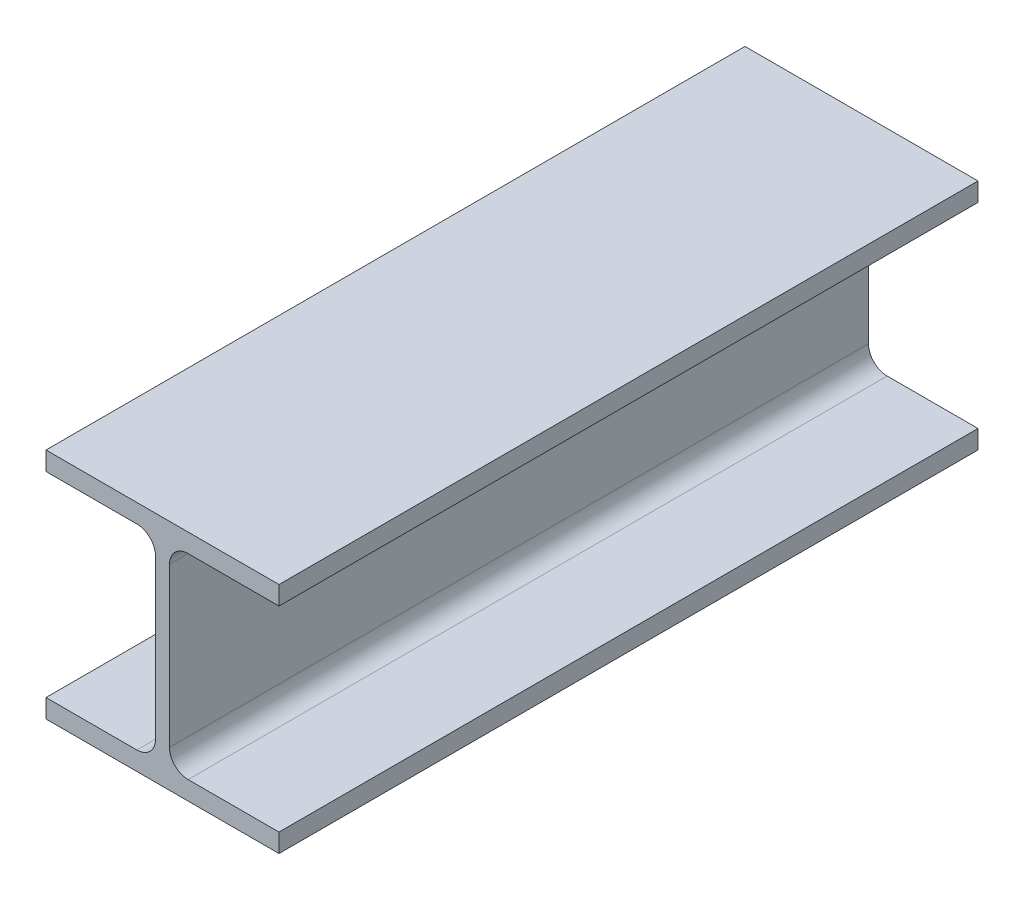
ISO-10303-21;
HEADER;
FILE_DESCRIPTION(('STEP AP214'),'2;1');
FILE_NAME('part.step','',(''),(''),'','','');
FILE_SCHEMA(('AUTOMOTIVE_DESIGN { 1 0 10303 214 1 1 1 1 }'));
ENDSEC;
DATA;
#1=APPLICATION_CONTEXT('core data for automotive mechanical design processes');
#2=APPLICATION_PROTOCOL_DEFINITION('international standard','automotive_design',2000,#1);
#3=PRODUCT_CONTEXT('',#1,'mechanical');
#4=PRODUCT('Part','Part','',(#3));
#5=PRODUCT_RELATED_PRODUCT_CATEGORY('part','',(#4));
#6=PRODUCT_DEFINITION_FORMATION('','',#4);
#7=PRODUCT_DEFINITION_CONTEXT('part definition',#1,'design');
#8=PRODUCT_DEFINITION('design','',#6,#7);
#9=PRODUCT_DEFINITION_SHAPE('','',#8);
#10=(LENGTH_UNIT() NAMED_UNIT(*) SI_UNIT(.MILLI.,.METRE.));
#11=(NAMED_UNIT(*) PLANE_ANGLE_UNIT() SI_UNIT($,.RADIAN.));
#12=(NAMED_UNIT(*) SI_UNIT($,.STERADIAN.) SOLID_ANGLE_UNIT());
#13=UNCERTAINTY_MEASURE_WITH_UNIT(LENGTH_MEASURE(1.E-05),#10,'distance_accuracy_value','');
#14=(GEOMETRIC_REPRESENTATION_CONTEXT(3) GLOBAL_UNCERTAINTY_ASSIGNED_CONTEXT((#13)) GLOBAL_UNIT_ASSIGNED_CONTEXT((#10,
#11,#12)) REPRESENTATION_CONTEXT('',''));
#15=CARTESIAN_POINT('',(0.,0.,0.));
#16=DIRECTION('',(0.,0.,1.));
#17=DIRECTION('',(1.,0.,0.));
#18=AXIS2_PLACEMENT_3D('',#15,#16,#17);
#19=CARTESIAN_POINT('',(-50.,-50.,300.));
#20=DIRECTION('',(1.,0.,0.));
#21=DIRECTION('',(0.,0.,-1.));
#22=AXIS2_PLACEMENT_3D('',#19,#20,#21);
#23=PLANE('',#22);
#24=DIRECTION('',(0.,-1.,0.));
#25=VECTOR('',#24,1.);
#26=CARTESIAN_POINT('',(-50.,-50.,0.));
#27=LINE('',#26,#25);
#28=CARTESIAN_POINT('',(-50.,-42.,0.));
#29=VERTEX_POINT('',#28);
#30=CARTESIAN_POINT('',(-50.,-50.,0.));
#31=VERTEX_POINT('',#30);
#32=EDGE_CURVE('E176',#29,#31,#27,.T.);
#33=ORIENTED_EDGE('',*,*,#32,.T.);
#34=DIRECTION('',(0.,0.,-1.));
#35=VECTOR('',#34,1.);
#36=CARTESIAN_POINT('',(-50.,-50.,300.));
#37=LINE('',#36,#35);
#38=CARTESIAN_POINT('',(-50.,-50.,300.));
#39=VERTEX_POINT('',#38);
#40=EDGE_CURVE('E11',#39,#31,#37,.T.);
#41=ORIENTED_EDGE('',*,*,#40,.F.);
#42=DIRECTION('',(0.,-1.,0.));
#43=VECTOR('',#42,1.);
#44=CARTESIAN_POINT('',(-50.,-50.,300.));
#45=LINE('',#44,#43);
#46=CARTESIAN_POINT('',(-50.,-42.,300.));
#47=VERTEX_POINT('',#46);
#48=EDGE_CURVE('E206',#47,#39,#45,.T.);
#49=ORIENTED_EDGE('',*,*,#48,.F.);
#50=DIRECTION('',(0.,0.,-1.));
#51=VECTOR('',#50,1.);
#52=CARTESIAN_POINT('',(-50.,-42.,300.));
#53=LINE('',#52,#51);
#54=EDGE_CURVE('E172',#47,#29,#53,.T.);
#55=ORIENTED_EDGE('',*,*,#54,.T.);
#56=EDGE_LOOP('',(#33,#41,#49,#55));
#57=FACE_BOUND('',#56,.T.);
#58=ADVANCED_FACE('F32',(#57),#23,.F.);
#59=CARTESIAN_POINT('',(50.,-50.,300.));
#60=DIRECTION('',(0.,1.,0.));
#61=DIRECTION('',(0.,0.,1.));
#62=AXIS2_PLACEMENT_3D('',#59,#60,#61);
#63=PLANE('',#62);
#64=DIRECTION('',(1.,0.,0.));
#65=VECTOR('',#64,1.);
#66=CARTESIAN_POINT('',(50.,-50.,0.));
#67=LINE('',#66,#65);
#68=CARTESIAN_POINT('',(50.,-50.,0.));
#69=VERTEX_POINT('',#68);
#70=EDGE_CURVE('E179',#31,#69,#67,.T.);
#71=ORIENTED_EDGE('',*,*,#70,.T.);
#72=DIRECTION('',(0.,0.,-1.));
#73=VECTOR('',#72,1.);
#74=CARTESIAN_POINT('',(50.,-50.,300.));
#75=LINE('',#74,#73);
#76=CARTESIAN_POINT('',(50.,-50.,300.));
#77=VERTEX_POINT('',#76);
#78=EDGE_CURVE('E40',#77,#69,#75,.T.);
#79=ORIENTED_EDGE('',*,*,#78,.F.);
#80=DIRECTION('',(1.,0.,0.));
#81=VECTOR('',#80,1.);
#82=CARTESIAN_POINT('',(50.,-50.,300.));
#83=LINE('',#82,#81);
#84=EDGE_CURVE('E115',#39,#77,#83,.T.);
#85=ORIENTED_EDGE('',*,*,#84,.F.);
#86=ORIENTED_EDGE('',*,*,#40,.T.);
#87=EDGE_LOOP('',(#71,#79,#85,#86));
#88=FACE_BOUND('',#87,.T.);
#89=ADVANCED_FACE('F304',(#88),#63,.F.);
#90=CARTESIAN_POINT('',(50.,-50.,300.));
#91=DIRECTION('',(-1.,0.,0.));
#92=DIRECTION('',(0.,0.,1.));
#93=AXIS2_PLACEMENT_3D('',#90,#91,#92);
#94=PLANE('',#93);
#95=DIRECTION('',(0.,1.,0.));
#96=VECTOR('',#95,1.);
#97=CARTESIAN_POINT('',(50.,-50.,0.));
#98=LINE('',#97,#96);
#99=CARTESIAN_POINT('',(50.,-42.,0.));
#100=VERTEX_POINT('',#99);
#101=EDGE_CURVE('E181',#69,#100,#98,.T.);
#102=ORIENTED_EDGE('',*,*,#101,.T.);
#103=DIRECTION('',(0.,0.,-1.));
#104=VECTOR('',#103,1.);
#105=CARTESIAN_POINT('',(50.,-42.,300.));
#106=LINE('',#105,#104);
#107=CARTESIAN_POINT('',(50.,-42.,300.));
#108=VERTEX_POINT('',#107);
#109=EDGE_CURVE('E237',#108,#100,#106,.T.);
#110=ORIENTED_EDGE('',*,*,#109,.F.);
#111=DIRECTION('',(0.,1.,0.));
#112=VECTOR('',#111,1.);
#113=CARTESIAN_POINT('',(50.,-50.,300.));
#114=LINE('',#113,#112);
#115=EDGE_CURVE('E245',#77,#108,#114,.T.);
#116=ORIENTED_EDGE('',*,*,#115,.F.);
#117=ORIENTED_EDGE('',*,*,#78,.T.);
#118=EDGE_LOOP('',(#102,#110,#116,#117));
#119=FACE_BOUND('',#118,.T.);
#120=ADVANCED_FACE('F243',(#119),#94,.F.);
#121=CARTESIAN_POINT('',(50.,-42.,300.));
#122=DIRECTION('',(0.,-1.,0.));
#123=DIRECTION('',(0.,0.,-1.));
#124=AXIS2_PLACEMENT_3D('',#121,#122,#123);
#125=PLANE('',#124);
#126=DIRECTION('',(-1.,0.,0.));
#127=VECTOR('',#126,1.);
#128=CARTESIAN_POINT('',(50.,-42.,0.));
#129=LINE('',#128,#127);
#130=CARTESIAN_POINT('',(11.,-42.,0.));
#131=VERTEX_POINT('',#130);
#132=EDGE_CURVE('E183',#100,#131,#129,.T.);
#133=ORIENTED_EDGE('',*,*,#132,.T.);
#134=DIRECTION('',(0.,0.,-1.));
#135=VECTOR('',#134,1.);
#136=CARTESIAN_POINT('',(11.,-42.,300.));
#137=LINE('',#136,#135);
#138=CARTESIAN_POINT('',(11.,-42.,300.));
#139=VERTEX_POINT('',#138);
#140=EDGE_CURVE('E234',#139,#131,#137,.T.);
#141=ORIENTED_EDGE('',*,*,#140,.F.);
#142=DIRECTION('',(-1.,0.,0.));
#143=VECTOR('',#142,1.);
#144=CARTESIAN_POINT('',(50.,-42.,300.));
#145=LINE('',#144,#143);
#146=EDGE_CURVE('E263',#108,#139,#145,.T.);
#147=ORIENTED_EDGE('',*,*,#146,.F.);
#148=ORIENTED_EDGE('',*,*,#109,.T.);
#149=EDGE_LOOP('',(#133,#141,#147,#148));
#150=FACE_BOUND('',#149,.T.);
#151=ADVANCED_FACE('F254',(#150),#125,.F.);
#152=CARTESIAN_POINT('',(11.,-34.,300.));
#153=DIRECTION('',(0.,0.,-1.));
#154=DIRECTION('',(-1.,0.,0.));
#155=AXIS2_PLACEMENT_3D('',#152,#153,#154);
#156=CYLINDRICAL_SURFACE('',#155,8.);
#157=CARTESIAN_POINT('',(11.,-34.,0.));
#158=DIRECTION('',(0.,0.,-1.));
#159=DIRECTION('',(-1.,0.,0.));
#160=AXIS2_PLACEMENT_3D('',#157,#158,#159);
#161=CIRCLE('',#160,8.);
#162=CARTESIAN_POINT('',(3.00000000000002,-34.,0.));
#163=VERTEX_POINT('',#162);
#164=EDGE_CURVE('E185',#131,#163,#161,.T.);
#165=ORIENTED_EDGE('',*,*,#164,.T.);
#166=DIRECTION('',(0.,0.,-1.));
#167=VECTOR('',#166,1.);
#168=CARTESIAN_POINT('',(3.00000000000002,-34.,300.));
#169=LINE('',#168,#167);
#170=CARTESIAN_POINT('',(3.00000000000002,-34.,300.));
#171=VERTEX_POINT('',#170);
#172=EDGE_CURVE('E231',#171,#163,#169,.T.);
#173=ORIENTED_EDGE('',*,*,#172,.F.);
#174=CARTESIAN_POINT('',(11.,-34.,300.));
#175=DIRECTION('',(0.,0.,-1.));
#176=DIRECTION('',(-1.,0.,0.));
#177=AXIS2_PLACEMENT_3D('',#174,#175,#176);
#178=CIRCLE('',#177,8.);
#179=EDGE_CURVE('E260',#139,#171,#178,.T.);
#180=ORIENTED_EDGE('',*,*,#179,.F.);
#181=ORIENTED_EDGE('',*,*,#140,.T.);
#182=EDGE_LOOP('',(#165,#173,#180,#181));
#183=FACE_BOUND('',#182,.T.);
#184=ADVANCED_FACE('F258',(#183),#156,.F.);
#185=CARTESIAN_POINT('',(3.00000000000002,-34.,300.));
#186=DIRECTION('',(-1.,0.,0.));
#187=DIRECTION('',(0.,-1.,0.));
#188=AXIS2_PLACEMENT_3D('',#185,#186,#187);
#189=PLANE('',#188);
#190=DIRECTION('',(0.,1.,0.));
#191=VECTOR('',#190,1.);
#192=CARTESIAN_POINT('',(3.00000000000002,-34.,0.));
#193=LINE('',#192,#191);
#194=CARTESIAN_POINT('',(3.00000000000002,34.,0.));
#195=VERTEX_POINT('',#194);
#196=EDGE_CURVE('E187',#163,#195,#193,.T.);
#197=ORIENTED_EDGE('',*,*,#196,.T.);
#198=DIRECTION('',(0.,0.,-1.));
#199=VECTOR('',#198,1.);
#200=CARTESIAN_POINT('',(3.00000000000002,34.,300.));
#201=LINE('',#200,#199);
#202=CARTESIAN_POINT('',(3.00000000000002,34.,300.));
#203=VERTEX_POINT('',#202);
#204=EDGE_CURVE('E228',#203,#195,#201,.T.);
#205=ORIENTED_EDGE('',*,*,#204,.F.);
#206=DIRECTION('',(0.,1.,0.));
#207=VECTOR('',#206,1.);
#208=CARTESIAN_POINT('',(3.00000000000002,-34.,300.));
#209=LINE('',#208,#207);
#210=EDGE_CURVE('E262',#171,#203,#209,.T.);
#211=ORIENTED_EDGE('',*,*,#210,.F.);
#212=ORIENTED_EDGE('',*,*,#172,.T.);
#213=EDGE_LOOP('',(#197,#205,#211,#212));
#214=FACE_BOUND('',#213,.T.);
#215=ADVANCED_FACE('F317',(#214),#189,.F.);
#216=CARTESIAN_POINT('',(11.,34.,300.));
#217=DIRECTION('',(0.,0.,-1.));
#218=DIRECTION('',(-1.,0.,0.));
#219=AXIS2_PLACEMENT_3D('',#216,#217,#218);
#220=CYLINDRICAL_SURFACE('',#219,8.);
#221=CARTESIAN_POINT('',(11.,34.,0.));
#222=DIRECTION('',(0.,0.,-1.));
#223=DIRECTION('',(1.,0.,0.));
#224=AXIS2_PLACEMENT_3D('',#221,#222,#223);
#225=CIRCLE('',#224,8.);
#226=CARTESIAN_POINT('',(11.,42.,0.));
#227=VERTEX_POINT('',#226);
#228=EDGE_CURVE('E189',#195,#227,#225,.T.);
#229=ORIENTED_EDGE('',*,*,#228,.T.);
#230=DIRECTION('',(0.,0.,-1.));
#231=VECTOR('',#230,1.);
#232=CARTESIAN_POINT('',(11.,42.,300.));
#233=LINE('',#232,#231);
#234=CARTESIAN_POINT('',(11.,42.,300.));
#235=VERTEX_POINT('',#234);
#236=EDGE_CURVE('E225',#235,#227,#233,.T.);
#237=ORIENTED_EDGE('',*,*,#236,.F.);
#238=CARTESIAN_POINT('',(11.,34.,300.));
#239=DIRECTION('',(0.,0.,-1.));
#240=DIRECTION('',(1.,0.,0.));
#241=AXIS2_PLACEMENT_3D('',#238,#239,#240);
#242=CIRCLE('',#241,8.);
#243=EDGE_CURVE('E265',#203,#235,#242,.T.);
#244=ORIENTED_EDGE('',*,*,#243,.F.);
#245=ORIENTED_EDGE('',*,*,#204,.T.);
#246=EDGE_LOOP('',(#229,#237,#244,#245));
#247=FACE_BOUND('',#246,.T.);
#248=ADVANCED_FACE('F320',(#247),#220,.F.);
#249=CARTESIAN_POINT('',(11.,42.,300.));
#250=DIRECTION('',(0.,1.,0.));
#251=DIRECTION('',(-1.,0.,0.));
#252=AXIS2_PLACEMENT_3D('',#249,#250,#251);
#253=PLANE('',#252);
#254=DIRECTION('',(1.,0.,0.));
#255=VECTOR('',#254,1.);
#256=CARTESIAN_POINT('',(11.,42.,0.));
#257=LINE('',#256,#255);
#258=CARTESIAN_POINT('',(50.,42.,0.));
#259=VERTEX_POINT('',#258);
#260=EDGE_CURVE('E191',#227,#259,#257,.T.);
#261=ORIENTED_EDGE('',*,*,#260,.T.);
#262=DIRECTION('',(0.,0.,-1.));
#263=VECTOR('',#262,1.);
#264=CARTESIAN_POINT('',(50.,42.,300.));
#265=LINE('',#264,#263);
#266=CARTESIAN_POINT('',(50.,42.,300.));
#267=VERTEX_POINT('',#266);
#268=EDGE_CURVE('E222',#267,#259,#265,.T.);
#269=ORIENTED_EDGE('',*,*,#268,.F.);
#270=DIRECTION('',(1.,0.,0.));
#271=VECTOR('',#270,1.);
#272=CARTESIAN_POINT('',(11.,42.,300.));
#273=LINE('',#272,#271);
#274=EDGE_CURVE('E271',#235,#267,#273,.T.);
#275=ORIENTED_EDGE('',*,*,#274,.F.);
#276=ORIENTED_EDGE('',*,*,#236,.T.);
#277=EDGE_LOOP('',(#261,#269,#275,#276));
#278=FACE_BOUND('',#277,.T.);
#279=ADVANCED_FACE('F324',(#278),#253,.F.);
#280=CARTESIAN_POINT('',(50.,42.,300.));
#281=DIRECTION('',(-1.,0.,0.));
#282=DIRECTION('',(0.,-1.,0.));
#283=AXIS2_PLACEMENT_3D('',#280,#281,#282);
#284=PLANE('',#283);
#285=DIRECTION('',(0.,1.,0.));
#286=VECTOR('',#285,1.);
#287=CARTESIAN_POINT('',(50.,42.,0.));
#288=LINE('',#287,#286);
#289=CARTESIAN_POINT('',(50.,50.,0.));
#290=VERTEX_POINT('',#289);
#291=EDGE_CURVE('E193',#259,#290,#288,.T.);
#292=ORIENTED_EDGE('',*,*,#291,.T.);
#293=DIRECTION('',(0.,0.,-1.));
#294=VECTOR('',#293,1.);
#295=CARTESIAN_POINT('',(50.,50.,300.));
#296=LINE('',#295,#294);
#297=CARTESIAN_POINT('',(50.,50.,300.));
#298=VERTEX_POINT('',#297);
#299=EDGE_CURVE('E219',#298,#290,#296,.T.);
#300=ORIENTED_EDGE('',*,*,#299,.F.);
#301=DIRECTION('',(0.,1.,0.));
#302=VECTOR('',#301,1.);
#303=CARTESIAN_POINT('',(50.,42.,300.));
#304=LINE('',#303,#302);
#305=EDGE_CURVE('E273',#267,#298,#304,.T.);
#306=ORIENTED_EDGE('',*,*,#305,.F.);
#307=ORIENTED_EDGE('',*,*,#268,.T.);
#308=EDGE_LOOP('',(#292,#300,#306,#307));
#309=FACE_BOUND('',#308,.T.);
#310=ADVANCED_FACE('F328',(#309),#284,.F.);
#311=CARTESIAN_POINT('',(-50.,50.,300.));
#312=DIRECTION('',(0.,-1.,0.));
#313=DIRECTION('',(0.,0.,-1.));
#314=AXIS2_PLACEMENT_3D('',#311,#312,#313);
#315=PLANE('',#314);
#316=DIRECTION('',(-1.,0.,0.));
#317=VECTOR('',#316,1.);
#318=CARTESIAN_POINT('',(-50.,50.,0.));
#319=LINE('',#318,#317);
#320=CARTESIAN_POINT('',(-50.,50.,0.));
#321=VERTEX_POINT('',#320);
#322=EDGE_CURVE('E195',#290,#321,#319,.T.);
#323=ORIENTED_EDGE('',*,*,#322,.T.);
#324=DIRECTION('',(0.,0.,-1.));
#325=VECTOR('',#324,1.);
#326=CARTESIAN_POINT('',(-50.,50.,300.));
#327=LINE('',#326,#325);
#328=CARTESIAN_POINT('',(-50.,50.,300.));
#329=VERTEX_POINT('',#328);
#330=EDGE_CURVE('E216',#329,#321,#327,.T.);
#331=ORIENTED_EDGE('',*,*,#330,.F.);
#332=DIRECTION('',(-1.,0.,0.));
#333=VECTOR('',#332,1.);
#334=CARTESIAN_POINT('',(-50.,50.,300.));
#335=LINE('',#334,#333);
#336=EDGE_CURVE('E275',#298,#329,#335,.T.);
#337=ORIENTED_EDGE('',*,*,#336,.F.);
#338=ORIENTED_EDGE('',*,*,#299,.T.);
#339=EDGE_LOOP('',(#323,#331,#337,#338));
#340=FACE_BOUND('',#339,.T.);
#341=ADVANCED_FACE('F332',(#340),#315,.F.);
#342=CARTESIAN_POINT('',(-50.,42.,300.));
#343=DIRECTION('',(1.,0.,0.));
#344=DIRECTION('',(0.,1.,0.));
#345=AXIS2_PLACEMENT_3D('',#342,#343,#344);
#346=PLANE('',#345);
#347=DIRECTION('',(0.,-1.,0.));
#348=VECTOR('',#347,1.);
#349=CARTESIAN_POINT('',(-50.,42.,0.));
#350=LINE('',#349,#348);
#351=CARTESIAN_POINT('',(-50.,42.,0.));
#352=VERTEX_POINT('',#351);
#353=EDGE_CURVE('E197',#321,#352,#350,.T.);
#354=ORIENTED_EDGE('',*,*,#353,.T.);
#355=DIRECTION('',(0.,0.,-1.));
#356=VECTOR('',#355,1.);
#357=CARTESIAN_POINT('',(-50.,42.,300.));
#358=LINE('',#357,#356);
#359=CARTESIAN_POINT('',(-50.,42.,300.));
#360=VERTEX_POINT('',#359);
#361=EDGE_CURVE('E213',#360,#352,#358,.T.);
#362=ORIENTED_EDGE('',*,*,#361,.F.);
#363=DIRECTION('',(0.,-1.,0.));
#364=VECTOR('',#363,1.);
#365=CARTESIAN_POINT('',(-50.,42.,300.));
#366=LINE('',#365,#364);
#367=EDGE_CURVE('E277',#329,#360,#366,.T.);
#368=ORIENTED_EDGE('',*,*,#367,.F.);
#369=ORIENTED_EDGE('',*,*,#330,.T.);
#370=EDGE_LOOP('',(#354,#362,#368,#369));
#371=FACE_BOUND('',#370,.T.);
#372=ADVANCED_FACE('F336',(#371),#346,.F.);
#373=CARTESIAN_POINT('',(-11.,42.,300.));
#374=DIRECTION('',(0.,1.,0.));
#375=DIRECTION('',(-1.,0.,0.));
#376=AXIS2_PLACEMENT_3D('',#373,#374,#375);
#377=PLANE('',#376);
#378=DIRECTION('',(1.,0.,0.));
#379=VECTOR('',#378,1.);
#380=CARTESIAN_POINT('',(-11.,42.,0.));
#381=LINE('',#380,#379);
#382=CARTESIAN_POINT('',(-11.,42.,0.));
#383=VERTEX_POINT('',#382);
#384=EDGE_CURVE('E199',#352,#383,#381,.T.);
#385=ORIENTED_EDGE('',*,*,#384,.T.);
#386=DIRECTION('',(0.,0.,-1.));
#387=VECTOR('',#386,1.);
#388=CARTESIAN_POINT('',(-11.,42.,300.));
#389=LINE('',#388,#387);
#390=CARTESIAN_POINT('',(-11.,42.,300.));
#391=VERTEX_POINT('',#390);
#392=EDGE_CURVE('E210',#391,#383,#389,.T.);
#393=ORIENTED_EDGE('',*,*,#392,.F.);
#394=DIRECTION('',(1.,0.,0.));
#395=VECTOR('',#394,1.);
#396=CARTESIAN_POINT('',(-11.,42.,300.));
#397=LINE('',#396,#395);
#398=EDGE_CURVE('E279',#360,#391,#397,.T.);
#399=ORIENTED_EDGE('',*,*,#398,.F.);
#400=ORIENTED_EDGE('',*,*,#361,.T.);
#401=EDGE_LOOP('',(#385,#393,#399,#400));
#402=FACE_BOUND('',#401,.T.);
#403=ADVANCED_FACE('F285',(#402),#377,.F.);
#404=CARTESIAN_POINT('',(-11.,34.,300.));
#405=DIRECTION('',(0.,0.,-1.));
#406=DIRECTION('',(-1.,0.,0.));
#407=AXIS2_PLACEMENT_3D('',#404,#405,#406);
#408=CYLINDRICAL_SURFACE('',#407,8.);
#409=CARTESIAN_POINT('',(-11.,34.,0.));
#410=DIRECTION('',(0.,0.,-1.));
#411=DIRECTION('',(-1.,0.,0.));
#412=AXIS2_PLACEMENT_3D('',#409,#410,#411);
#413=CIRCLE('',#412,8.);
#414=CARTESIAN_POINT('',(-3.,34.,0.));
#415=VERTEX_POINT('',#414);
#416=EDGE_CURVE('E201',#383,#415,#413,.T.);
#417=ORIENTED_EDGE('',*,*,#416,.T.);
#418=DIRECTION('',(0.,0.,-1.));
#419=VECTOR('',#418,1.);
#420=CARTESIAN_POINT('',(-3.,34.,300.));
#421=LINE('',#420,#419);
#422=CARTESIAN_POINT('',(-3.,34.,300.));
#423=VERTEX_POINT('',#422);
#424=EDGE_CURVE('E167',#423,#415,#421,.T.);
#425=ORIENTED_EDGE('',*,*,#424,.F.);
#426=CARTESIAN_POINT('',(-11.,34.,300.));
#427=DIRECTION('',(0.,0.,-1.));
#428=DIRECTION('',(-1.,0.,0.));
#429=AXIS2_PLACEMENT_3D('',#426,#427,#428);
#430=CIRCLE('',#429,8.);
#431=EDGE_CURVE('E158',#391,#423,#430,.T.);
#432=ORIENTED_EDGE('',*,*,#431,.F.);
#433=ORIENTED_EDGE('',*,*,#392,.T.);
#434=EDGE_LOOP('',(#417,#425,#432,#433));
#435=FACE_BOUND('',#434,.T.);
#436=ADVANCED_FACE('F289',(#435),#408,.F.);
#437=CARTESIAN_POINT('',(-3.,-34.,300.));
#438=DIRECTION('',(1.,0.,0.));
#439=DIRECTION('',(0.,1.,0.));
#440=AXIS2_PLACEMENT_3D('',#437,#438,#439);
#441=PLANE('',#440);
#442=DIRECTION('',(0.,-1.,0.));
#443=VECTOR('',#442,1.);
#444=CARTESIAN_POINT('',(-3.,-34.,0.));
#445=LINE('',#444,#443);
#446=CARTESIAN_POINT('',(-3.,-34.,0.));
#447=VERTEX_POINT('',#446);
#448=EDGE_CURVE('E166',#415,#447,#445,.T.);
#449=ORIENTED_EDGE('',*,*,#448,.T.);
#450=DIRECTION('',(0.,0.,-1.));
#451=VECTOR('',#450,1.);
#452=CARTESIAN_POINT('',(-3.,-34.,300.));
#453=LINE('',#452,#451);
#454=CARTESIAN_POINT('',(-3.,-34.,300.));
#455=VERTEX_POINT('',#454);
#456=EDGE_CURVE('E163',#455,#447,#453,.T.);
#457=ORIENTED_EDGE('',*,*,#456,.F.);
#458=DIRECTION('',(0.,-1.,0.));
#459=VECTOR('',#458,1.);
#460=CARTESIAN_POINT('',(-3.,-34.,300.));
#461=LINE('',#460,#459);
#462=EDGE_CURVE('E152',#423,#455,#461,.T.);
#463=ORIENTED_EDGE('',*,*,#462,.F.);
#464=ORIENTED_EDGE('',*,*,#424,.T.);
#465=EDGE_LOOP('',(#449,#457,#463,#464));
#466=FACE_BOUND('',#465,.T.);
#467=ADVANCED_FACE('F164',(#466),#441,.F.);
#468=CARTESIAN_POINT('',(-11.,-34.,300.));
#469=DIRECTION('',(0.,0.,-1.));
#470=DIRECTION('',(-1.,0.,0.));
#471=AXIS2_PLACEMENT_3D('',#468,#469,#470);
#472=CYLINDRICAL_SURFACE('',#471,8.);
#473=CARTESIAN_POINT('',(-11.,-34.,0.));
#474=DIRECTION('',(0.,0.,-1.));
#475=DIRECTION('',(1.,0.,0.));
#476=AXIS2_PLACEMENT_3D('',#473,#474,#475);
#477=CIRCLE('',#476,8.);
#478=CARTESIAN_POINT('',(-11.,-42.,0.));
#479=VERTEX_POINT('',#478);
#480=EDGE_CURVE('E101',#447,#479,#477,.T.);
#481=ORIENTED_EDGE('',*,*,#480,.T.);
#482=DIRECTION('',(0.,0.,-1.));
#483=VECTOR('',#482,1.);
#484=CARTESIAN_POINT('',(-11.,-42.,300.));
#485=LINE('',#484,#483);
#486=CARTESIAN_POINT('',(-11.,-42.,300.));
#487=VERTEX_POINT('',#486);
#488=EDGE_CURVE('E168',#487,#479,#485,.T.);
#489=ORIENTED_EDGE('',*,*,#488,.F.);
#490=CARTESIAN_POINT('',(-11.,-34.,300.));
#491=DIRECTION('',(0.,0.,-1.));
#492=DIRECTION('',(1.,0.,0.));
#493=AXIS2_PLACEMENT_3D('',#490,#491,#492);
#494=CIRCLE('',#493,8.);
#495=EDGE_CURVE('E156',#455,#487,#494,.T.);
#496=ORIENTED_EDGE('',*,*,#495,.F.);
#497=ORIENTED_EDGE('',*,*,#456,.T.);
#498=EDGE_LOOP('',(#481,#489,#496,#497));
#499=FACE_BOUND('',#498,.T.);
#500=ADVANCED_FACE('F170',(#499),#472,.F.);
#501=CARTESIAN_POINT('',(-50.,-42.,300.));
#502=DIRECTION('',(0.,-1.,0.));
#503=DIRECTION('',(0.,0.,-1.));
#504=AXIS2_PLACEMENT_3D('',#501,#502,#503);
#505=PLANE('',#504);
#506=DIRECTION('',(-1.,0.,0.));
#507=VECTOR('',#506,1.);
#508=CARTESIAN_POINT('',(-50.,-42.,0.));
#509=LINE('',#508,#507);
#510=EDGE_CURVE('E107',#479,#29,#509,.T.);
#511=ORIENTED_EDGE('',*,*,#510,.T.);
#512=ORIENTED_EDGE('',*,*,#54,.F.);
#513=DIRECTION('',(-1.,0.,0.));
#514=VECTOR('',#513,1.);
#515=CARTESIAN_POINT('',(-50.,-42.,300.));
#516=LINE('',#515,#514);
#517=EDGE_CURVE('E48',#487,#47,#516,.T.);
#518=ORIENTED_EDGE('',*,*,#517,.F.);
#519=ORIENTED_EDGE('',*,*,#488,.T.);
#520=EDGE_LOOP('',(#511,#512,#518,#519));
#521=FACE_BOUND('',#520,.T.);
#522=ADVANCED_FACE('F293',(#521),#505,.F.);
#523=CARTESIAN_POINT('',(-11.,-34.,300.));
#524=DIRECTION('',(0.,0.,1.));
#525=DIRECTION('',(1.,0.,0.));
#526=AXIS2_PLACEMENT_3D('',#523,#524,#525);
#527=PLANE('',#526);
#528=ORIENTED_EDGE('',*,*,#48,.T.);
#529=ORIENTED_EDGE('',*,*,#84,.T.);
#530=ORIENTED_EDGE('',*,*,#115,.T.);
#531=ORIENTED_EDGE('',*,*,#146,.T.);
#532=ORIENTED_EDGE('',*,*,#179,.T.);
#533=ORIENTED_EDGE('',*,*,#210,.T.);
#534=ORIENTED_EDGE('',*,*,#243,.T.);
#535=ORIENTED_EDGE('',*,*,#274,.T.);
#536=ORIENTED_EDGE('',*,*,#305,.T.);
#537=ORIENTED_EDGE('',*,*,#336,.T.);
#538=ORIENTED_EDGE('',*,*,#367,.T.);
#539=ORIENTED_EDGE('',*,*,#398,.T.);
#540=ORIENTED_EDGE('',*,*,#431,.T.);
#541=ORIENTED_EDGE('',*,*,#462,.T.);
#542=ORIENTED_EDGE('',*,*,#495,.T.);
#543=ORIENTED_EDGE('',*,*,#517,.T.);
#544=EDGE_LOOP('',(#528,#529,#530,#531,#532,#533,#534,#535,#536,#537,#538,#539,#540,#541,#542,#543));
#545=FACE_BOUND('',#544,.T.);
#546=ADVANCED_FACE('F154',(#545),#527,.T.);
#547=CARTESIAN_POINT('',(-11.,-34.,0.));
#548=DIRECTION('',(0.,0.,1.));
#549=DIRECTION('',(1.,0.,0.));
#550=AXIS2_PLACEMENT_3D('',#547,#548,#549);
#551=PLANE('',#550);
#552=ORIENTED_EDGE('',*,*,#32,.F.);
#553=ORIENTED_EDGE('',*,*,#510,.F.);
#554=ORIENTED_EDGE('',*,*,#480,.F.);
#555=ORIENTED_EDGE('',*,*,#448,.F.);
#556=ORIENTED_EDGE('',*,*,#416,.F.);
#557=ORIENTED_EDGE('',*,*,#384,.F.);
#558=ORIENTED_EDGE('',*,*,#353,.F.);
#559=ORIENTED_EDGE('',*,*,#322,.F.);
#560=ORIENTED_EDGE('',*,*,#291,.F.);
#561=ORIENTED_EDGE('',*,*,#260,.F.);
#562=ORIENTED_EDGE('',*,*,#228,.F.);
#563=ORIENTED_EDGE('',*,*,#196,.F.);
#564=ORIENTED_EDGE('',*,*,#164,.F.);
#565=ORIENTED_EDGE('',*,*,#132,.F.);
#566=ORIENTED_EDGE('',*,*,#101,.F.);
#567=ORIENTED_EDGE('',*,*,#70,.F.);
#568=EDGE_LOOP('',(#552,#553,#554,#555,#556,#557,#558,#559,#560,#561,#562,#563,#564,#565,#566,#567));
#569=FACE_BOUND('',#568,.T.);
#570=ADVANCED_FACE('F249',(#569),#551,.F.);
#571=CLOSED_SHELL('',(#58,#89,#120,#151,#184,#215,#248,#279,#310,#341,#372,#403,#436,#467,#500,
#522,#546,#570));
#572=MANIFOLD_SOLID_BREP('B2',#571);
#573=ADVANCED_BREP_SHAPE_REPRESENTATION('',(#18,#572),#14);
#574=SHAPE_DEFINITION_REPRESENTATION(#9,#573);
ENDSEC;
END-ISO-10303-21;
